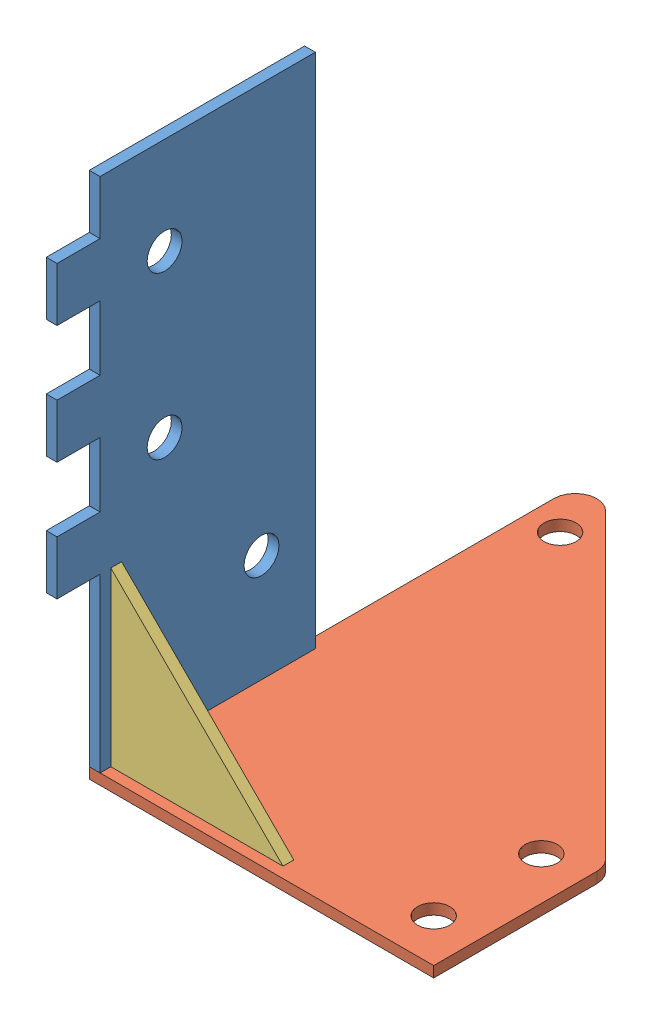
SolidWorks assembly 3 Prong Base Half.SLDASM, configuration Default (file format 10000). Lengths in mm.
Overall size (203.2 311.15 312.17).
3 component instances, 3 part files, 6 mates.
Components (placement in the parent):
- Prototype Base 3 Prong-1: Prototype Base 3 Prong.SLDPRT [Default] at (137.9133 21.3984 198.5097) size (6.35 304.8 152.4)
- Base Bottom-1: Base Bottom.SLDPRT [Default] at (134.7383 21.3984 262.0097) x (-1 0 0) z (0 0 1) size (203.2 6.35 286.77)
- Base Plate Gusset-1: Base Plate Gusset.SLDPRT [Default] at (141.0883 21.3984 249.3097) size (101.6 101.6 6.35)
Mates (geometry in assembly coordinates):
- Coincident1: coincident aligned: plane of Prototype Base 3 Prong-1 through (134.7383 326.1984 135.0097) normal (-1 0 0); plane of Base Bottom-1 through (134.7383 15.0484 262.0097) normal (-1 0 0)
- Coincident2: coincident aligned: plane of Prototype Base 3 Prong-1 through (134.7383 326.1984 262.0097) normal (0 0 1); plane of Base Bottom-1 through (337.9383 15.0484 262.0097) normal (0 0 1)
- Coincident3: coincident anti-aligned: plane of Prototype Base 3 Prong-1 through (137.9133 21.3984 198.5097) normal (0 -1 0); plane of Base Bottom-1 through (325.2383 21.3984 165.7437) normal (0 1 0)
- Coincident4: coincident anti-aligned: plane of Prototype Base 3 Prong-1 through (141.0883 326.1984 135.0097) normal (1 0 0); plane of Base Plate Gusset-1 through (141.0883 122.9984 255.6597) normal (-1 0 0)
- Coincident5: coincident anti-aligned: plane of Base Bottom-1 through (325.2383 21.3984 165.7437) normal (0 1 0); plane of Base Plate Gusset-1 through (141.0883 21.3984 255.6597) normal (0 -1 0)
- Distance1: distance = 6.35 mm aligned: plane of Base Plate Gusset-1 through (141.0883 21.3984 255.6597) normal (0 0 1); plane of Base Bottom-1 through (337.9383 15.0484 262.0097) normal (0 0 1)
